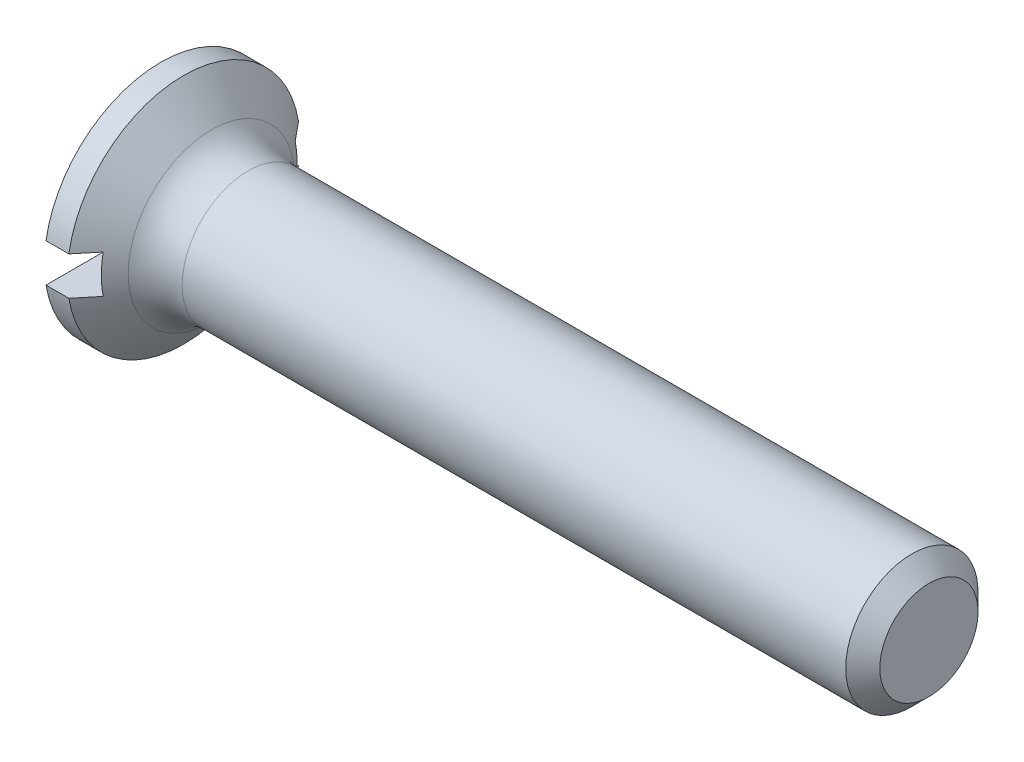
ISO-10303-21;
HEADER;
FILE_DESCRIPTION(('STEP AP214'),'2;1');
FILE_NAME('part.step','',(''),(''),'','','');
FILE_SCHEMA(('AUTOMOTIVE_DESIGN { 1 0 10303 214 1 1 1 1 }'));
ENDSEC;
DATA;
#1=APPLICATION_CONTEXT('core data for automotive mechanical design processes');
#2=APPLICATION_PROTOCOL_DEFINITION('international standard','automotive_design',2000,#1);
#3=PRODUCT_CONTEXT('',#1,'mechanical');
#4=PRODUCT('Part','Part','',(#3));
#5=PRODUCT_RELATED_PRODUCT_CATEGORY('part','',(#4));
#6=PRODUCT_DEFINITION_FORMATION('','',#4);
#7=PRODUCT_DEFINITION_CONTEXT('part definition',#1,'design');
#8=PRODUCT_DEFINITION('design','',#6,#7);
#9=PRODUCT_DEFINITION_SHAPE('','',#8);
#10=(LENGTH_UNIT() NAMED_UNIT(*) SI_UNIT(.MILLI.,.METRE.));
#11=(NAMED_UNIT(*) PLANE_ANGLE_UNIT() SI_UNIT($,.RADIAN.));
#12=(NAMED_UNIT(*) SI_UNIT($,.STERADIAN.) SOLID_ANGLE_UNIT());
#13=UNCERTAINTY_MEASURE_WITH_UNIT(LENGTH_MEASURE(1.E-05),#10,'distance_accuracy_value','');
#14=(GEOMETRIC_REPRESENTATION_CONTEXT(3) GLOBAL_UNCERTAINTY_ASSIGNED_CONTEXT((#13)) GLOBAL_UNIT_ASSIGNED_CONTEXT((#10,
#11,#12)) REPRESENTATION_CONTEXT('',''));
#15=CARTESIAN_POINT('',(0.,0.,0.));
#16=DIRECTION('',(0.,0.,1.));
#17=DIRECTION('',(1.,0.,0.));
#18=AXIS2_PLACEMENT_3D('',#15,#16,#17);
#19=CARTESIAN_POINT('',(-25.4,0.,0.));
#20=DIRECTION('',(-1.,0.,0.));
#21=DIRECTION('',(0.,0.,1.));
#22=AXIS2_PLACEMENT_3D('',#19,#20,#21);
#23=CYLINDRICAL_SURFACE('',#22,1.2319);
#24=DIRECTION('',(-1.,0.,0.));
#25=VECTOR('',#24,1.);
#26=CARTESIAN_POINT('',(-25.4,0.2032,-1.21502566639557));
#27=LINE('',#26,#25);
#28=CARTESIAN_POINT('',(0.,0.2032,-1.21502566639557));
#29=VERTEX_POINT('',#28);
#30=CARTESIAN_POINT('',(0.241904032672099,0.2032,-1.21502566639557));
#31=VERTEX_POINT('',#30);
#32=EDGE_CURVE('E56',#29,#31,#27,.F.);
#33=ORIENTED_EDGE('',*,*,#32,.F.);
#34=CARTESIAN_POINT('',(0.,0.,0.));
#35=DIRECTION('',(-1.,0.,0.));
#36=DIRECTION('',(0.,0.,1.));
#37=AXIS2_PLACEMENT_3D('',#34,#35,#36);
#38=CIRCLE('',#37,1.2319);
#39=CARTESIAN_POINT('',(0.,0.2032,1.21502566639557));
#40=VERTEX_POINT('',#39);
#41=EDGE_CURVE('E104',#40,#29,#38,.T.);
#42=ORIENTED_EDGE('',*,*,#41,.F.);
#43=DIRECTION('',(-1.,0.,0.));
#44=VECTOR('',#43,1.);
#45=CARTESIAN_POINT('',(-25.4,0.2032,1.21502566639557));
#46=LINE('',#45,#44);
#47=CARTESIAN_POINT('',(0.241904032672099,0.2032,1.21502566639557));
#48=VERTEX_POINT('',#47);
#49=EDGE_CURVE('E140',#48,#40,#46,.T.);
#50=ORIENTED_EDGE('',*,*,#49,.F.);
#51=CARTESIAN_POINT('',(0.241904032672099,0.,0.));
#52=DIRECTION('',(-1.,0.,0.));
#53=DIRECTION('',(0.,0.,1.));
#54=AXIS2_PLACEMENT_3D('',#51,#52,#53);
#55=CIRCLE('',#54,1.2319);
#56=EDGE_CURVE('E92',#48,#31,#55,.T.);
#57=ORIENTED_EDGE('',*,*,#56,.T.);
#58=EDGE_LOOP('',(#33,#42,#50,#57));
#59=FACE_BOUND('',#58,.T.);
#60=ADVANCED_FACE('F33',(#59),#23,.T.);
#61=CARTESIAN_POINT('',(0.,0.,0.));
#62=DIRECTION('',(-1.,0.,0.));
#63=DIRECTION('',(0.,0.,1.));
#64=AXIS2_PLACEMENT_3D('',#61,#62,#63);
#65=PLANE('',#64);
#66=DIRECTION('',(0.,0.,-1.));
#67=VECTOR('',#66,1.);
#68=CARTESIAN_POINT('',(0.,0.2032,0.));
#69=LINE('',#68,#67);
#70=EDGE_CURVE('E91',#40,#29,#69,.T.);
#71=ORIENTED_EDGE('',*,*,#70,.F.);
#72=ORIENTED_EDGE('',*,*,#41,.T.);
#73=EDGE_LOOP('',(#71,#72));
#74=FACE_BOUND('',#73,.T.);
#75=ADVANCED_FACE('F168',(#74),#65,.T.);
#76=CARTESIAN_POINT('',(0.241904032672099,0.,0.));
#77=DIRECTION('',(-1.,0.,0.));
#78=DIRECTION('',(0.,0.,1.));
#79=AXIS2_PLACEMENT_3D('',#76,#77,#78);
#80=CONICAL_SURFACE('',#79,1.2319,0.872664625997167);
#81=CARTESIAN_POINT('',(0.536147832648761,0.,0.));
#82=DIRECTION('',(-1.,0.,0.));
#83=DIRECTION('',(0.,0.,1.));
#84=AXIS2_PLACEMENT_3D('',#81,#82,#83);
#85=CIRCLE('',#84,0.881233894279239);
#86=CARTESIAN_POINT('',(0.536147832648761,0.,0.881233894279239));
#87=VERTEX_POINT('',#86);
#88=EDGE_CURVE('E41',#87,#87,#85,.T.);
#89=ORIENTED_EDGE('',*,*,#88,.T.);
#90=EDGE_LOOP('',(#89));
#91=FACE_BOUND('',#90,.T.);
#92=CARTESIAN_POINT('',(-1.00782435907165,0.2032,-2.71367111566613));
#93=CARTESIAN_POINT('',(-0.929345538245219,0.2032,-2.61987981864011));
#94=CARTESIAN_POINT('',(-0.850878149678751,0.2032,-2.52607894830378));
#95=CARTESIAN_POINT('',(-0.693972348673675,0.2032,-2.33843560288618));
#96=CARTESIAN_POINT('',(-0.615533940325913,0.2032,-2.24459312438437));
#97=CARTESIAN_POINT('',(-0.4585421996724,0.2032,-2.0566644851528));
#98=CARTESIAN_POINT('',(-0.379988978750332,0.2032,-1.96257823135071));
#99=CARTESIAN_POINT('',(-0.222971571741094,0.2032,-1.77434862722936));
#100=CARTESIAN_POINT('',(-0.144507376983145,0.2032,-1.6802052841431));
#101=CARTESIAN_POINT('',(0.019941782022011,0.2032,-1.48262378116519));
#102=CARTESIAN_POINT('',(0.105913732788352,0.2032,-1.37917477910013));
#103=CARTESIAN_POINT('',(0.234664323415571,0.2032,-1.22379899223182));
#104=CARTESIAN_POINT('',(0.277554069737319,0.2032,-1.17196431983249));
#105=CARTESIAN_POINT('',(0.363220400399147,0.2032,-1.06820532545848));
#106=CARTESIAN_POINT('',(0.405996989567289,0.2032,-1.01628100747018));
#107=CARTESIAN_POINT('',(0.491314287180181,0.2032,-0.912372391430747));
#108=CARTESIAN_POINT('',(0.53385525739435,0.2032,-0.860388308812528));
#109=CARTESIAN_POINT('',(0.61865771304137,0.2032,-0.756178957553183));
#110=CARTESIAN_POINT('',(0.66091915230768,0.2032,-0.703953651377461));
#111=CARTESIAN_POINT('',(0.744906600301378,0.2032,-0.599125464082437));
#112=CARTESIAN_POINT('',(0.786632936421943,0.2032,-0.546522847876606));
#113=CARTESIAN_POINT('',(0.848356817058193,0.2032,-0.466957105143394));
#114=CARTESIAN_POINT('',(0.868784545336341,0.2032,-0.440328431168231));
#115=CARTESIAN_POINT('',(0.909166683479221,0.2032,-0.386715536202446));
#116=CARTESIAN_POINT('',(0.929121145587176,0.2032,-0.359731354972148));
#117=CARTESIAN_POINT('',(0.958698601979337,0.2032,-0.318413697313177));
#118=CARTESIAN_POINT('',(0.968631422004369,0.2032,-0.304302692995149));
#119=CARTESIAN_POINT('',(0.988181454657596,0.2032,-0.275857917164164));
#120=CARTESIAN_POINT('',(0.997798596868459,0.2032,-0.26152409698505));
#121=CARTESIAN_POINT('',(1.01656529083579,0.2032,-0.232565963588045));
#122=CARTESIAN_POINT('',(1.02571518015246,0.2032,-0.217941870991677));
#123=CARTESIAN_POINT('',(1.04331174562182,0.2032,-0.188278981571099));
#124=CARTESIAN_POINT('',(1.05175872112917,0.2032,-0.173240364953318));
#125=CARTESIAN_POINT('',(1.06795047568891,0.2032,-0.141799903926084));
#126=CARTESIAN_POINT('',(1.07563762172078,0.2032,-0.125367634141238));
#127=CARTESIAN_POINT('',(1.08894068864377,0.2032,-0.0916962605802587));
#128=CARTESIAN_POINT('',(1.09456356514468,0.2032,-0.0744600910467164));
#129=CARTESIAN_POINT('',(1.10172700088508,0.2032,-0.0427243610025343));
#130=CARTESIAN_POINT('',(1.10385882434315,0.2032,-0.0283662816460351));
#131=CARTESIAN_POINT('',(1.10551088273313,0.2032,0.000478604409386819));
#132=CARTESIAN_POINT('',(1.10503698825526,0.2032,0.0149650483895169));
#133=CARTESIAN_POINT('',(1.10117123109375,0.2032,0.0472851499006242));
#134=CARTESIAN_POINT('',(1.0970645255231,0.2032,0.0650279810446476));
#135=CARTESIAN_POINT('',(1.08614915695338,0.2032,0.09973023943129));
#136=CARTESIAN_POINT('',(1.07932057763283,0.2032,0.11668283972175));
#137=CARTESIAN_POINT('',(1.06455917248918,0.2032,0.148753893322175));
#138=CARTESIAN_POINT('',(1.0567261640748,0.2032,0.163920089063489));
#139=CARTESIAN_POINT('',(1.04017648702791,0.2032,0.193768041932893));
#140=CARTESIAN_POINT('',(1.03145917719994,0.2032,0.208449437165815));
#141=CARTESIAN_POINT('',(1.00443164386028,0.2032,0.252050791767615));
#142=CARTESIAN_POINT('',(0.985287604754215,0.2032,0.280447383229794));
#143=CARTESIAN_POINT('',(0.945893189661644,0.2032,0.336638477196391));
#144=CARTESIAN_POINT('',(0.925638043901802,0.2032,0.364429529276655));
#145=CARTESIAN_POINT('',(0.884586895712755,0.2032,0.419531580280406));
#146=CARTESIAN_POINT('',(0.86379193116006,0.2032,0.446843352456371));
#147=CARTESIAN_POINT('',(0.80148620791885,0.2032,0.527643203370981));
#148=CARTESIAN_POINT('',(0.759495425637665,0.2032,0.580758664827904));
#149=CARTESIAN_POINT('',(0.674953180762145,0.2032,0.686543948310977));
#150=CARTESIAN_POINT('',(0.632401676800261,0.2032,0.73921373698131));
#151=CARTESIAN_POINT('',(0.546956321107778,0.2032,0.844344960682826));
#152=CARTESIAN_POINT('',(0.504062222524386,0.2032,0.896806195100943));
#153=CARTESIAN_POINT('',(0.418093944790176,0.2032,1.00157776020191));
#154=CARTESIAN_POINT('',(0.375019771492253,0.2032,1.0538880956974));
#155=CARTESIAN_POINT('',(0.246067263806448,0.2032,1.21014394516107));
#156=CARTESIAN_POINT('',(0.160020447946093,0.2032,1.31395036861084));
#157=CARTESIAN_POINT('',(-0.0122628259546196,0.2032,1.52136132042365));
#158=CARTESIAN_POINT('',(-0.0984992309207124,0.2032,1.62496589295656));
#159=CARTESIAN_POINT('',(-0.253139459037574,0.2032,1.81052778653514));
#160=CARTESIAN_POINT('',(-0.321520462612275,0.2032,1.89250412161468));
#161=CARTESIAN_POINT('',(-0.458339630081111,0.2032,2.0564198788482));
#162=CARTESIAN_POINT('',(-0.526777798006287,0.2032,2.13835929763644));
#163=CARTESIAN_POINT('',(-0.663971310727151,0.2032,2.3025435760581));
#164=CARTESIAN_POINT('',(-0.732726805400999,0.2032,2.38478831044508));
#165=CARTESIAN_POINT('',(-0.870259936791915,0.2032,2.54924828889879));
#166=CARTESIAN_POINT('',(-0.939037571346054,0.2032,2.63146353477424));
#167=CARTESIAN_POINT('',(-1.00782435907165,0.2032,2.71367111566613));
#168=B_SPLINE_CURVE_WITH_KNOTS('',3,(#92,#93,#94,#95,#96,#97,#98,#99,#100,#101,#102,#103,#104,
#105,#106,#107,#108,#109,#110,#111,#112,#113,#114,#115,#116,#117,#118,#119,#120,#121,#122,#123,
#124,#125,#126,#127,#128,#129,#130,#131,#132,#133,#134,#135,#136,#137,#138,#139,#140,#141,#142,
#143,#144,#145,#146,#147,#148,#149,#150,#151,#152,#153,#154,#155,#156,#157,#158,#159,#160,#161,
#162,#163,#164,#165,#166,#167),.UNSPECIFIED.,.F.,.F.,(4,2,2,2,2,2,2,2,2,2,2,2,2,2,2,2,2,2,2,2,2,
2,2,2,2,2,2,2,2,2,2,2,2,2,2,2,2,4),(0.,0.36688090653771,0.733801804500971,1.10150475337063,
1.46916813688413,1.87269703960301,2.07453168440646,2.27635757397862,2.47787272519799,
2.67942036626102,2.88083816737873,2.98152060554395,3.08219187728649,3.13395798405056,
3.18573556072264,3.23747518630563,3.28919266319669,3.34354278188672,3.39770804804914,
3.44104865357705,3.48429165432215,3.53858708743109,3.59328732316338,3.64445430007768,
3.69565864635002,3.79833860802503,3.90150037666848,4.00447667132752,4.20759281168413,
4.41072402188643,4.61401789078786,4.81730520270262,5.22180215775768,5.62619749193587,
5.94645473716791,6.26673688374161,6.58833232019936,6.90990250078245),.UNSPECIFIED.);
#169=CARTESIAN_POINT('',(0.4064,0.2032,1.01573543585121));
#170=VERTEX_POINT('',#169);
#171=EDGE_CURVE('E133',#170,#48,#168,.T.);
#172=ORIENTED_EDGE('',*,*,#171,.F.);
#173=CARTESIAN_POINT('',(0.4064,0.,0.));
#174=DIRECTION('',(1.,0.,0.));
#175=DIRECTION('',(0.,0.,-1.));
#176=AXIS2_PLACEMENT_3D('',#173,#174,#175);
#177=CIRCLE('',#176,1.03586133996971);
#178=CARTESIAN_POINT('',(0.4064,-0.2032,1.01573543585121));
#179=VERTEX_POINT('',#178);
#180=EDGE_CURVE('E116',#179,#170,#177,.F.);
#181=ORIENTED_EDGE('',*,*,#180,.F.);
#182=CARTESIAN_POINT('',(-1.00782435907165,-0.2032,2.71367111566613));
#183=CARTESIAN_POINT('',(-0.929345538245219,-0.2032,2.61987981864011));
#184=CARTESIAN_POINT('',(-0.850878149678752,-0.2032,2.52607894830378));
#185=CARTESIAN_POINT('',(-0.693972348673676,-0.2032,2.33843560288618));
#186=CARTESIAN_POINT('',(-0.615533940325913,-0.2032,2.24459312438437));
#187=CARTESIAN_POINT('',(-0.458542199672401,-0.2032,2.0566644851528));
#188=CARTESIAN_POINT('',(-0.379988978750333,-0.2032,1.96257823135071));
#189=CARTESIAN_POINT('',(-0.222971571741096,-0.2032,1.77434862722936));
#190=CARTESIAN_POINT('',(-0.144507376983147,-0.2032,1.68020528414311));
#191=CARTESIAN_POINT('',(0.0199417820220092,-0.2032,1.48262378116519));
#192=CARTESIAN_POINT('',(0.105913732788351,-0.2032,1.37917477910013));
#193=CARTESIAN_POINT('',(0.234664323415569,-0.2032,1.22379899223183));
#194=CARTESIAN_POINT('',(0.277554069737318,-0.2032,1.17196431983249));
#195=CARTESIAN_POINT('',(0.363220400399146,-0.2032,1.06820532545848));
#196=CARTESIAN_POINT('',(0.405996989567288,-0.2032,1.01628100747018));
#197=CARTESIAN_POINT('',(0.49131428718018,-0.2032,0.912372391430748));
#198=CARTESIAN_POINT('',(0.533855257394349,-0.2032,0.860388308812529));
#199=CARTESIAN_POINT('',(0.618657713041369,-0.2032,0.756178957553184));
#200=CARTESIAN_POINT('',(0.660919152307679,-0.2032,0.703953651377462));
#201=CARTESIAN_POINT('',(0.744906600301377,-0.2032,0.599125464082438));
#202=CARTESIAN_POINT('',(0.786632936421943,-0.2032,0.546522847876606));
#203=CARTESIAN_POINT('',(0.848356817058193,-0.2032,0.466957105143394));
#204=CARTESIAN_POINT('',(0.868784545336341,-0.2032,0.440328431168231));
#205=CARTESIAN_POINT('',(0.909166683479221,-0.2032,0.386715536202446));
#206=CARTESIAN_POINT('',(0.929121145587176,-0.2032,0.359731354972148));
#207=CARTESIAN_POINT('',(0.958698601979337,-0.2032,0.318413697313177));
#208=CARTESIAN_POINT('',(0.968631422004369,-0.2032,0.304302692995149));
#209=CARTESIAN_POINT('',(0.988181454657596,-0.2032,0.275857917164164));
#210=CARTESIAN_POINT('',(0.997798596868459,-0.2032,0.26152409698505));
#211=CARTESIAN_POINT('',(1.01656529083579,-0.2032,0.232565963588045));
#212=CARTESIAN_POINT('',(1.02571518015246,-0.2032,0.217941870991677));
#213=CARTESIAN_POINT('',(1.04331174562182,-0.2032,0.188278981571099));
#214=CARTESIAN_POINT('',(1.05175872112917,-0.2032,0.173240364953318));
#215=CARTESIAN_POINT('',(1.06795047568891,-0.2032,0.141799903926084));
#216=CARTESIAN_POINT('',(1.07563762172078,-0.2032,0.125367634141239));
#217=CARTESIAN_POINT('',(1.08894068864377,-0.2032,0.0916962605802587));
#218=CARTESIAN_POINT('',(1.09456356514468,-0.2032,0.0744600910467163));
#219=CARTESIAN_POINT('',(1.10172700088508,-0.2032,0.0427243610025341));
#220=CARTESIAN_POINT('',(1.10385882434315,-0.2032,0.0283662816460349));
#221=CARTESIAN_POINT('',(1.10551088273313,-0.2032,-0.000478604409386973));
#222=CARTESIAN_POINT('',(1.10503698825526,-0.2032,-0.0149650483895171));
#223=CARTESIAN_POINT('',(1.10117123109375,-0.2032,-0.0472851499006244));
#224=CARTESIAN_POINT('',(1.0970645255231,-0.2032,-0.0650279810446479));
#225=CARTESIAN_POINT('',(1.08614915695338,-0.2032,-0.0997302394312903));
#226=CARTESIAN_POINT('',(1.07932057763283,-0.2032,-0.116682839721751));
#227=CARTESIAN_POINT('',(1.06455917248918,-0.2032,-0.148753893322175));
#228=CARTESIAN_POINT('',(1.05672616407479,-0.2032,-0.163920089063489));
#229=CARTESIAN_POINT('',(1.04017648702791,-0.2032,-0.193768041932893));
#230=CARTESIAN_POINT('',(1.03145917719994,-0.2032,-0.208449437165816));
#231=CARTESIAN_POINT('',(1.00443164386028,-0.2032,-0.252050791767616));
#232=CARTESIAN_POINT('',(0.985287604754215,-0.2032,-0.280447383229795));
#233=CARTESIAN_POINT('',(0.945893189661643,-0.2032,-0.336638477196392));
#234=CARTESIAN_POINT('',(0.925638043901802,-0.2032,-0.364429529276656));
#235=CARTESIAN_POINT('',(0.884586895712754,-0.2032,-0.419531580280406));
#236=CARTESIAN_POINT('',(0.863791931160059,-0.2032,-0.446843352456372));
#237=CARTESIAN_POINT('',(0.80148620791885,-0.2032,-0.527643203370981));
#238=CARTESIAN_POINT('',(0.759495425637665,-0.2032,-0.580758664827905));
#239=CARTESIAN_POINT('',(0.674953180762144,-0.2032,-0.686543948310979));
#240=CARTESIAN_POINT('',(0.63240167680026,-0.2032,-0.739213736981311));
#241=CARTESIAN_POINT('',(0.546956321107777,-0.2032,-0.844344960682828));
#242=CARTESIAN_POINT('',(0.504062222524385,-0.2032,-0.896806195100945));
#243=CARTESIAN_POINT('',(0.418093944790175,-0.2032,-1.00157776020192));
#244=CARTESIAN_POINT('',(0.375019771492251,-0.2032,-1.05388809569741));
#245=CARTESIAN_POINT('',(0.246067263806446,-0.2032,-1.21014394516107));
#246=CARTESIAN_POINT('',(0.160020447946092,-0.2032,-1.31395036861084));
#247=CARTESIAN_POINT('',(-0.0122628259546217,-0.2032,-1.52136132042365));
#248=CARTESIAN_POINT('',(-0.0984992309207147,-0.2032,-1.62496589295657));
#249=CARTESIAN_POINT('',(-0.253139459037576,-0.2032,-1.81052778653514));
#250=CARTESIAN_POINT('',(-0.321520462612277,-0.2032,-1.89250412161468));
#251=CARTESIAN_POINT('',(-0.458339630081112,-0.2032,-2.0564198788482));
#252=CARTESIAN_POINT('',(-0.526777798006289,-0.2032,-2.13835929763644));
#253=CARTESIAN_POINT('',(-0.663971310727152,-0.2032,-2.3025435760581));
#254=CARTESIAN_POINT('',(-0.732726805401,-0.2032,-2.38478831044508));
#255=CARTESIAN_POINT('',(-0.870259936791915,-0.2032,-2.54924828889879));
#256=CARTESIAN_POINT('',(-0.939037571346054,-0.2032,-2.63146353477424));
#257=CARTESIAN_POINT('',(-1.00782435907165,-0.2032,-2.71367111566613));
#258=B_SPLINE_CURVE_WITH_KNOTS('',3,(#182,#183,#184,#185,#186,#187,#188,#189,#190,#191,#192,
#193,#194,#195,#196,#197,#198,#199,#200,#201,#202,#203,#204,#205,#206,#207,#208,#209,#210,#211,
#212,#213,#214,#215,#216,#217,#218,#219,#220,#221,#222,#223,#224,#225,#226,#227,#228,#229,#230,
#231,#232,#233,#234,#235,#236,#237,#238,#239,#240,#241,#242,#243,#244,#245,#246,#247,#248,#249,
#250,#251,#252,#253,#254,#255,#256,#257),.UNSPECIFIED.,.F.,.F.,(4,2,2,2,2,2,2,2,2,2,2,2,2,2,2,2,
2,2,2,2,2,2,2,2,2,2,2,2,2,2,2,2,2,2,2,2,2,4),(0.,0.366880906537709,0.73380180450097,
1.10150475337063,1.46916813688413,1.872697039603,2.07453168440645,2.27635757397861,
2.47787272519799,2.67942036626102,2.88083816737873,2.98152060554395,3.08219187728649,
3.13395798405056,3.18573556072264,3.23747518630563,3.28919266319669,3.34354278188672,
3.39770804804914,3.44104865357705,3.48429165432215,3.53858708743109,3.59328732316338,
3.64445430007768,3.69565864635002,3.79833860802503,3.90150037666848,4.00447667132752,
4.20759281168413,4.41072402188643,4.61401789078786,4.81730520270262,5.22180215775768,
5.62619749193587,5.94645473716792,6.26673688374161,6.58833232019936,6.90990250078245),.UNSPECIFIED.);
#259=CARTESIAN_POINT('',(0.241904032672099,-0.2032,1.21502566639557));
#260=VERTEX_POINT('',#259);
#261=EDGE_CURVE('E100',#260,#179,#258,.T.);
#262=ORIENTED_EDGE('',*,*,#261,.F.);
#263=CARTESIAN_POINT('',(0.241904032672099,-0.2032,-1.21502566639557));
#264=VERTEX_POINT('',#263);
#265=EDGE_CURVE('E99',#264,#260,#55,.T.);
#266=ORIENTED_EDGE('',*,*,#265,.F.);
#267=CARTESIAN_POINT('',(0.4064,-0.2032,-1.01573543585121));
#268=VERTEX_POINT('',#267);
#269=EDGE_CURVE('E101',#268,#264,#258,.T.);
#270=ORIENTED_EDGE('',*,*,#269,.F.);
#271=CARTESIAN_POINT('',(0.4064,0.2032,-1.01573543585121));
#272=VERTEX_POINT('',#271);
#273=EDGE_CURVE('E115',#272,#268,#177,.F.);
#274=ORIENTED_EDGE('',*,*,#273,.F.);
#275=EDGE_CURVE('E135',#31,#272,#168,.T.);
#276=ORIENTED_EDGE('',*,*,#275,.F.);
#277=ORIENTED_EDGE('',*,*,#56,.F.);
#278=EDGE_LOOP('',(#172,#181,#262,#266,#270,#274,#276,#277));
#279=FACE_BOUND('',#278,.T.);
#280=ADVANCED_FACE('F138',(#91,#279),#80,.T.);
#281=DIRECTION('',(-1.,0.,0.));
#282=VECTOR('',#281,1.);
#283=CARTESIAN_POINT('',(-25.4,-0.2032,1.21502566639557));
#284=LINE('',#283,#282);
#285=CARTESIAN_POINT('',(0.,-0.2032,1.21502566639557));
#286=VERTEX_POINT('',#285);
#287=EDGE_CURVE('E86',#286,#260,#284,.F.);
#288=ORIENTED_EDGE('',*,*,#287,.F.);
#289=CARTESIAN_POINT('',(0.,-0.2032,-1.21502566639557));
#290=VERTEX_POINT('',#289);
#291=EDGE_CURVE('E97',#290,#286,#38,.T.);
#292=ORIENTED_EDGE('',*,*,#291,.F.);
#293=DIRECTION('',(-1.,0.,0.));
#294=VECTOR('',#293,1.);
#295=CARTESIAN_POINT('',(-25.4,-0.2032,-1.21502566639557));
#296=LINE('',#295,#294);
#297=EDGE_CURVE('E48',#264,#290,#296,.T.);
#298=ORIENTED_EDGE('',*,*,#297,.F.);
#299=ORIENTED_EDGE('',*,*,#265,.T.);
#300=EDGE_LOOP('',(#288,#292,#298,#299));
#301=FACE_BOUND('',#300,.T.);
#302=ADVANCED_FACE('F96',(#301),#23,.T.);
#303=DIRECTION('',(0.,0.,1.));
#304=VECTOR('',#303,1.);
#305=CARTESIAN_POINT('',(0.,-0.2032,0.));
#306=LINE('',#305,#304);
#307=EDGE_CURVE('E83',#290,#286,#306,.T.);
#308=ORIENTED_EDGE('',*,*,#307,.F.);
#309=ORIENTED_EDGE('',*,*,#291,.T.);
#310=EDGE_LOOP('',(#308,#309));
#311=FACE_BOUND('',#310,.T.);
#312=ADVANCED_FACE('F103',(#311),#65,.T.);
#313=CARTESIAN_POINT('',(8.128,0.51943,0.));
#314=DIRECTION('',(1.,0.,0.));
#315=DIRECTION('',(0.,0.,-1.));
#316=AXIS2_PLACEMENT_3D('',#313,#314,#315);
#317=PLANE('',#316);
#318=CARTESIAN_POINT('',(8.128,0.,0.));
#319=DIRECTION('',(-1.,0.,0.));
#320=DIRECTION('',(0.,0.,1.));
#321=AXIS2_PLACEMENT_3D('',#318,#319,#320);
#322=CIRCLE('',#321,0.51943);
#323=CARTESIAN_POINT('',(8.128,0.,0.51943));
#324=VERTEX_POINT('',#323);
#325=EDGE_CURVE('E105',#324,#324,#322,.T.);
#326=ORIENTED_EDGE('',*,*,#325,.F.);
#327=EDGE_LOOP('',(#326));
#328=FACE_BOUND('',#327,.T.);
#329=ADVANCED_FACE('F156',(#328),#317,.T.);
#330=CARTESIAN_POINT('',(7.94766,0.,0.));
#331=DIRECTION('',(-1.,0.,0.));
#332=DIRECTION('',(0.,0.,1.));
#333=AXIS2_PLACEMENT_3D('',#330,#331,#332);
#334=CONICAL_SURFACE('',#333,0.69977,0.785398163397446);
#335=ORIENTED_EDGE('',*,*,#325,.T.);
#336=EDGE_LOOP('',(#335));
#337=FACE_BOUND('',#336,.T.);
#338=CARTESIAN_POINT('',(7.94766,0.,0.));
#339=DIRECTION('',(-1.,0.,0.));
#340=DIRECTION('',(0.,0.,1.));
#341=AXIS2_PLACEMENT_3D('',#338,#339,#340);
#342=CIRCLE('',#341,0.69977);
#343=CARTESIAN_POINT('',(7.94766,0.,0.69977));
#344=VERTEX_POINT('',#343);
#345=EDGE_CURVE('E109',#344,#344,#342,.T.);
#346=ORIENTED_EDGE('',*,*,#345,.F.);
#347=EDGE_LOOP('',(#346));
#348=FACE_BOUND('',#347,.T.);
#349=ADVANCED_FACE('F154',(#337,#348),#334,.T.);
#350=CARTESIAN_POINT('',(-25.4,0.,0.));
#351=DIRECTION('',(-1.,0.,0.));
#352=DIRECTION('',(0.,0.,1.));
#353=AXIS2_PLACEMENT_3D('',#350,#351,#352);
#354=CYLINDRICAL_SURFACE('',#353,0.69977);
#355=CARTESIAN_POINT('',(0.925298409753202,0.,0.));
#356=DIRECTION('',(-1.,0.,0.));
#357=DIRECTION('',(0.,0.,1.));
#358=AXIS2_PLACEMENT_3D('',#355,#356,#357);
#359=CIRCLE('',#358,0.69977);
#360=CARTESIAN_POINT('',(0.925298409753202,0.,0.69977));
#361=VERTEX_POINT('',#360);
#362=EDGE_CURVE('E11',#361,#361,#359,.F.);
#363=ORIENTED_EDGE('',*,*,#362,.T.);
#364=EDGE_LOOP('',(#363));
#365=FACE_BOUND('',#364,.T.);
#366=ORIENTED_EDGE('',*,*,#345,.T.);
#367=EDGE_LOOP('',(#366));
#368=FACE_BOUND('',#367,.T.);
#369=ADVANCED_FACE('F152',(#365,#368),#354,.T.);
#370=CARTESIAN_POINT('',(0.4064,0.2032,1.2319));
#371=DIRECTION('',(0.,1.,0.));
#372=DIRECTION('',(0.,0.,1.));
#373=AXIS2_PLACEMENT_3D('',#370,#371,#372);
#374=PLANE('',#373);
#375=ORIENTED_EDGE('',*,*,#275,.T.);
#376=DIRECTION('',(0.,0.,-1.));
#377=VECTOR('',#376,1.);
#378=CARTESIAN_POINT('',(0.4064,0.2032,1.2319));
#379=LINE('',#378,#377);
#380=EDGE_CURVE('E126',#170,#272,#379,.T.);
#381=ORIENTED_EDGE('',*,*,#380,.F.);
#382=ORIENTED_EDGE('',*,*,#171,.T.);
#383=ORIENTED_EDGE('',*,*,#49,.T.);
#384=ORIENTED_EDGE('',*,*,#70,.T.);
#385=ORIENTED_EDGE('',*,*,#32,.T.);
#386=EDGE_LOOP('',(#375,#381,#382,#383,#384,#385));
#387=FACE_BOUND('',#386,.T.);
#388=ADVANCED_FACE('F132',(#387),#374,.F.);
#389=CARTESIAN_POINT('',(0.4064,-0.2032,-1.2319));
#390=DIRECTION('',(0.,-1.,0.));
#391=DIRECTION('',(0.,0.,-1.));
#392=AXIS2_PLACEMENT_3D('',#389,#390,#391);
#393=PLANE('',#392);
#394=ORIENTED_EDGE('',*,*,#261,.T.);
#395=DIRECTION('',(0.,0.,1.));
#396=VECTOR('',#395,1.);
#397=CARTESIAN_POINT('',(0.4064,-0.2032,-1.2319));
#398=LINE('',#397,#396);
#399=EDGE_CURVE('E129',#268,#179,#398,.T.);
#400=ORIENTED_EDGE('',*,*,#399,.F.);
#401=ORIENTED_EDGE('',*,*,#269,.T.);
#402=ORIENTED_EDGE('',*,*,#297,.T.);
#403=ORIENTED_EDGE('',*,*,#307,.T.);
#404=ORIENTED_EDGE('',*,*,#287,.T.);
#405=EDGE_LOOP('',(#394,#400,#401,#402,#403,#404));
#406=FACE_BOUND('',#405,.T.);
#407=ADVANCED_FACE('F85',(#406),#393,.F.);
#408=CARTESIAN_POINT('',(0.4064,-0.2032,-1.2319));
#409=DIRECTION('',(1.,0.,0.));
#410=DIRECTION('',(0.,0.,-1.));
#411=AXIS2_PLACEMENT_3D('',#408,#409,#410);
#412=PLANE('',#411);
#413=ORIENTED_EDGE('',*,*,#180,.T.);
#414=ORIENTED_EDGE('',*,*,#380,.T.);
#415=ORIENTED_EDGE('',*,*,#273,.T.);
#416=ORIENTED_EDGE('',*,*,#399,.T.);
#417=EDGE_LOOP('',(#413,#414,#415,#416));
#418=FACE_BOUND('',#417,.T.);
#419=ADVANCED_FACE('F125',(#418),#412,.F.);
#420=CARTESIAN_POINT('',(0.925298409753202,0.,0.));
#421=DIRECTION('',(-1.,0.,0.));
#422=DIRECTION('',(0.,0.,1.));
#423=AXIS2_PLACEMENT_3D('',#420,#421,#422);
#424=TOROIDAL_SURFACE('',#423,1.20777,0.508);
#425=ORIENTED_EDGE('',*,*,#362,.F.);
#426=EDGE_LOOP('',(#425));
#427=FACE_BOUND('',#426,.T.);
#428=ORIENTED_EDGE('',*,*,#88,.F.);
#429=EDGE_LOOP('',(#428));
#430=FACE_BOUND('',#429,.T.);
#431=ADVANCED_FACE('F35',(#427,#430),#424,.F.);
#432=CLOSED_SHELL('',(#60,#75,#280,#302,#312,#329,#349,#369,#388,#407,#419,#431));
#433=MANIFOLD_SOLID_BREP('B2',#432);
#434=ADVANCED_BREP_SHAPE_REPRESENTATION('',(#18,#433),#14);
#435=SHAPE_DEFINITION_REPRESENTATION(#9,#434);
ENDSEC;
END-ISO-10303-21;
